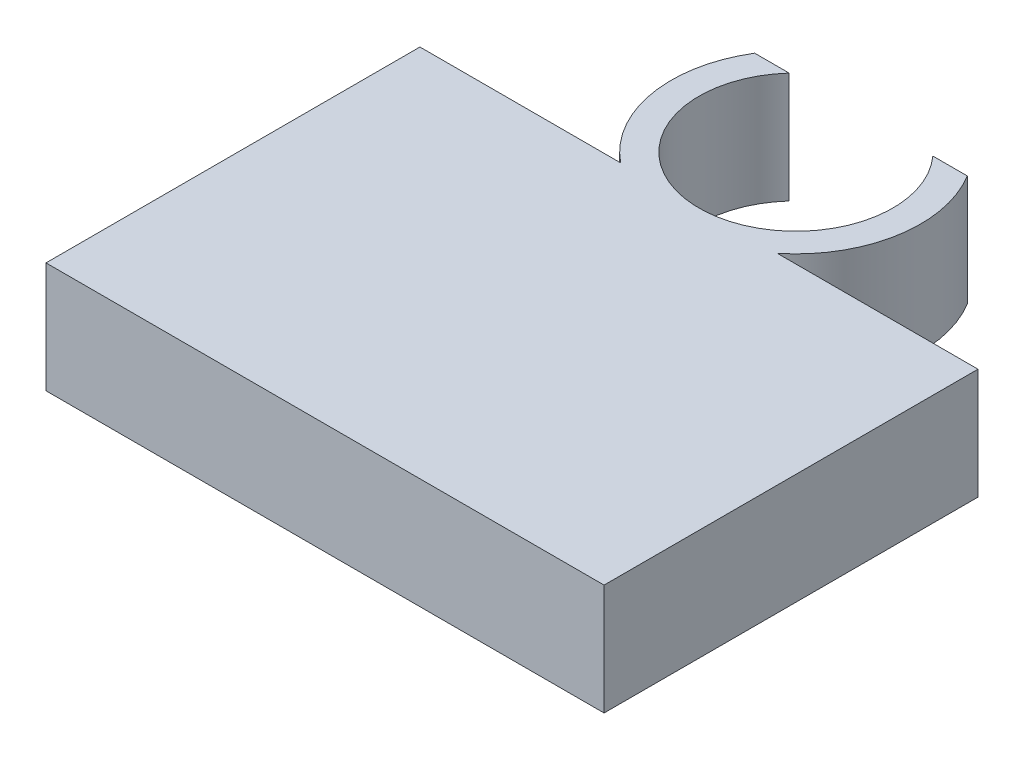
from build123d import *
from build123d.topology import SkipClean

# Parameters (mm, degrees)
SKETCH_1_R          = 2.25
SKETCH_1_R_2        = 1.75
EXTRUDE_1_DEPTH     = 2
EXTRUDE_START       = -2
EXTRUDE_2_DEPTH     = 2
SKETCH_4_W          = 9.800525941
SKETCH_4_H          = 0.981836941
CUT_EXTRUDE_1_DEPTH = 2
SKETCH_5_W          = 9.876163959
SKETCH_5_H          = 0.615909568
CUT_EXTRUDE_2_DEPTH = 2
EXTRUDE_3_DEPTH     = 2
SKETCH_7_W          = 10.07405788
SKETCH_7_H          = 5.75
EXTRUDE_4_DEPTH     = 2


with BuildPart() as part:
    # Sketch 1 → Extrude 1 (new body)
    with BuildSketch(Plane(origin=(0, 0, 0), x_dir=(1, 0, 0), z_dir=(0, 1, 0))):
        with Locations(Location((0, 0, 0), (0, 0, 270))):
            Circle(SKETCH_1_R)
        with Locations(Location((0, 0, 0), (0, 0, 270))):
            Circle(SKETCH_1_R_2, mode=Mode.SUBTRACT)
    extrude(amount=EXTRUDE_1_DEPTH)

    # Sketch 2 → Extrude 2 (add)
    with BuildSketch(Plane(origin=(0, 2, 0), x_dir=(1, 0, 0), z_dir=(0, 1, 0)).offset(EXTRUDE_START)):
        with BuildLine():
            ThreePointArc((1.414213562, -1.75), (0.75, -2.121320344), (0, -2.25))
            Line((0, -2.25), (0, -2.75))
            Line((0, -2.75), (5.03702894, -2.75))
            Line((5.03702894, -2.75), (5.03702894, -1.75))
            Line((5.03702894, -1.75), (1.414213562, -1.75))
        make_face()
        with BuildLine():
            Line((0, -2.75), (0, -2.25))
            ThreePointArc((0, -2.25), (-0.75, -2.121320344), (-1.414213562, -1.75))
            Line((-1.414213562, -1.75), (-5.03702894, -1.75))
            Line((-5.03702894, -1.75), (-5.03702894, -2.75))
            Line((-5.03702894, -2.75), (0, -2.75))
        make_face()
    extrude(amount=EXTRUDE_2_DEPTH)

    # Sketch 4 → Cut-Extrude 1 (cut)
    with BuildSketch(Plane.XZ):
        with Locations((0.113457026, -1.759081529)):
            Rectangle(SKETCH_4_W, SKETCH_4_H)
    extrude(amount=-CUT_EXTRUDE_1_DEPTH, mode=Mode.SUBTRACT)

    # Sketch 5 → Cut-Extrude 2 (cut)
    with BuildSketch(Plane.XZ):
        with Locations((0.140470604, -1.096004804)):
            Rectangle(SKETCH_5_W, SKETCH_5_H)
    extrude(amount=-CUT_EXTRUDE_2_DEPTH, mode=Mode.SUBTRACT)

    # Sketch 6 → Extrude 3 (add)
    with SkipClean():  # the faces are left unmerged after this step: merging them gives an invalid solid
        with BuildSketch(Plane.XZ):
            with BuildLine():
                ThreePointArc((-2.107481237, -0.78805002), (-2.022501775, -0.985893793), (-1.918999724, -1.1747085))
                Line((-1.918999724, -1.1747085), (-1.297135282, -1.1747085))
                ThreePointArc((-1.297135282, -1.1747085), (-1.442839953, -0.990309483), (-1.562522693, -0.78805002))
                Line((-1.562522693, -0.78805002), (-2.107481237, -0.78805002))
            make_face()
            with BuildLine():
                ThreePointArc((1.562522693, -0.78805002), (1.442839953, -0.990309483), (1.297135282, -1.1747085))
                Line((1.297135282, -1.1747085), (1.918999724, -1.1747085))
                ThreePointArc((1.918999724, -1.1747085), (2.022501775, -0.985893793), (2.107481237, -0.78805002))
                Line((2.107481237, -0.78805002), (1.562522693, -0.78805002))
            make_face()
        extrude(amount=-EXTRUDE_3_DEPTH)

    # Sketch 7 → Extrude 4 (add)
    with SkipClean():  # the faces are left unmerged after this step: merging them gives an invalid solid
        with BuildSketch(Plane(origin=(0, 2, 0), x_dir=(1, 0, 0), z_dir=(0, 1, 0))):
            with Locations((0, -5.625)):
                Rectangle(SKETCH_7_W, SKETCH_7_H)
        extrude(amount=-EXTRUDE_4_DEPTH)


solid = part.part
